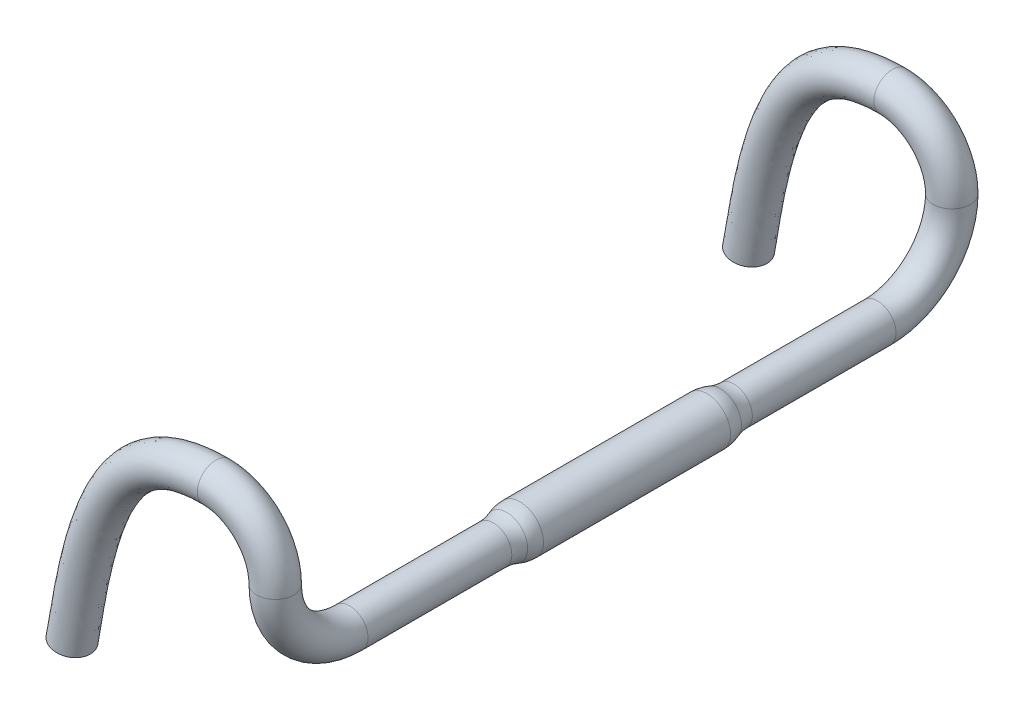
ISO-10303-21;
HEADER;
FILE_DESCRIPTION(('STEP AP214'),'2;1');
FILE_NAME('part.step','',(''),(''),'','','');
FILE_SCHEMA(('AUTOMOTIVE_DESIGN { 1 0 10303 214 1 1 1 1 }'));
ENDSEC;
DATA;
#1=APPLICATION_CONTEXT('core data for automotive mechanical design processes');
#2=APPLICATION_PROTOCOL_DEFINITION('international standard','automotive_design',2000,#1);
#3=PRODUCT_CONTEXT('',#1,'mechanical');
#4=PRODUCT('Part','Part','',(#3));
#5=PRODUCT_RELATED_PRODUCT_CATEGORY('part','',(#4));
#6=PRODUCT_DEFINITION_FORMATION('','',#4);
#7=PRODUCT_DEFINITION_CONTEXT('part definition',#1,'design');
#8=PRODUCT_DEFINITION('design','',#6,#7);
#9=PRODUCT_DEFINITION_SHAPE('','',#8);
#10=(LENGTH_UNIT() NAMED_UNIT(*) SI_UNIT(.MILLI.,.METRE.));
#11=(NAMED_UNIT(*) PLANE_ANGLE_UNIT() SI_UNIT($,.RADIAN.));
#12=(NAMED_UNIT(*) SI_UNIT($,.STERADIAN.) SOLID_ANGLE_UNIT());
#13=UNCERTAINTY_MEASURE_WITH_UNIT(LENGTH_MEASURE(1.E-05),#10,'distance_accuracy_value','');
#14=(GEOMETRIC_REPRESENTATION_CONTEXT(3) GLOBAL_UNCERTAINTY_ASSIGNED_CONTEXT((#13)) GLOBAL_UNIT_ASSIGNED_CONTEXT((#10,
#11,#12)) REPRESENTATION_CONTEXT('',''));
#15=CARTESIAN_POINT('',(0.,0.,0.));
#16=DIRECTION('',(0.,0.,1.));
#17=DIRECTION('',(1.,0.,0.));
#18=AXIS2_PLACEMENT_3D('',#15,#16,#17);
#19=CARTESIAN_POINT('',(0.,0.,81.));
#20=DIRECTION('',(0.,0.,1.));
#21=DIRECTION('',(1.,0.,0.));
#22=AXIS2_PLACEMENT_3D('',#19,#20,#21);
#23=TOROIDAL_SURFACE('',#22,37.8704545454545,25.3704545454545);
#24=CARTESIAN_POINT('',(0.,0.,72.));
#25=DIRECTION('',(0.,0.,1.));
#26=DIRECTION('',(1.,0.,0.));
#27=AXIS2_PLACEMENT_3D('',#24,#25,#26);
#28=CIRCLE('',#27,14.15);
#29=CARTESIAN_POINT('',(14.15,0.,72.));
#30=VERTEX_POINT('',#29);
#31=EDGE_CURVE('E11',#30,#30,#28,.T.);
#32=ORIENTED_EDGE('',*,*,#31,.T.);
#33=EDGE_LOOP('',(#32));
#34=FACE_BOUND('',#33,.T.);
#35=CARTESIAN_POINT('',(0.,0.,81.));
#36=DIRECTION('',(0.,0.,1.));
#37=DIRECTION('',(1.,0.,0.));
#38=AXIS2_PLACEMENT_3D('',#35,#36,#37);
#39=CIRCLE('',#38,12.5);
#40=CARTESIAN_POINT('',(12.5,0.,81.));
#41=VERTEX_POINT('',#40);
#42=EDGE_CURVE('E169',#41,#41,#39,.T.);
#43=ORIENTED_EDGE('',*,*,#42,.F.);
#44=EDGE_LOOP('',(#43));
#45=FACE_BOUND('',#44,.T.);
#46=ADVANCED_FACE('F117',(#34,#45),#23,.F.);
#47=CARTESIAN_POINT('',(0.,0.,63.));
#48=DIRECTION('',(0.,0.,1.));
#49=DIRECTION('',(1.,0.,0.));
#50=AXIS2_PLACEMENT_3D('',#47,#48,#49);
#51=DEGENERATE_TOROIDAL_SURFACE('',#50,9.57045454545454,25.3704545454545,.F.);
#52=CARTESIAN_POINT('',(0.,0.,63.));
#53=DIRECTION('',(0.,0.,1.));
#54=DIRECTION('',(1.,0.,0.));
#55=AXIS2_PLACEMENT_3D('',#52,#53,#54);
#56=CIRCLE('',#55,15.8);
#57=CARTESIAN_POINT('',(15.8,0.,63.));
#58=VERTEX_POINT('',#57);
#59=EDGE_CURVE('E123',#58,#58,#56,.T.);
#60=ORIENTED_EDGE('',*,*,#59,.T.);
#61=EDGE_LOOP('',(#60));
#62=FACE_BOUND('',#61,.T.);
#63=ORIENTED_EDGE('',*,*,#31,.F.);
#64=EDGE_LOOP('',(#63));
#65=FACE_BOUND('',#64,.T.);
#66=ADVANCED_FACE('F238',(#62,#65),#51,.F.);
#67=CARTESIAN_POINT('',(0.,0.,109.303925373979));
#68=DIRECTION('',(0.,0.,1.));
#69=DIRECTION('',(1.,0.,0.));
#70=AXIS2_PLACEMENT_3D('',#67,#68,#69);
#71=CYLINDRICAL_SURFACE('',#70,15.8);
#72=ORIENTED_EDGE('',*,*,#59,.F.);
#73=EDGE_LOOP('',(#72));
#74=FACE_BOUND('',#73,.T.);
#75=CARTESIAN_POINT('',(0.,0.,-63.));
#76=DIRECTION('',(0.,0.,1.));
#77=DIRECTION('',(1.,0.,0.));
#78=AXIS2_PLACEMENT_3D('',#75,#76,#77);
#79=CIRCLE('',#78,15.8);
#80=CARTESIAN_POINT('',(15.8,0.,-63.));
#81=VERTEX_POINT('',#80);
#82=EDGE_CURVE('E127',#81,#81,#79,.T.);
#83=ORIENTED_EDGE('',*,*,#82,.T.);
#84=EDGE_LOOP('',(#83));
#85=FACE_BOUND('',#84,.T.);
#86=ADVANCED_FACE('F242',(#74,#85),#71,.T.);
#87=CARTESIAN_POINT('',(0.,0.,-63.));
#88=DIRECTION('',(0.,0.,1.));
#89=DIRECTION('',(1.,0.,0.));
#90=AXIS2_PLACEMENT_3D('',#87,#88,#89);
#91=DEGENERATE_TOROIDAL_SURFACE('',#90,9.57045454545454,25.3704545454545,.F.);
#92=ORIENTED_EDGE('',*,*,#82,.F.);
#93=EDGE_LOOP('',(#92));
#94=FACE_BOUND('',#93,.T.);
#95=CARTESIAN_POINT('',(0.,0.,-72.));
#96=DIRECTION('',(0.,0.,1.));
#97=DIRECTION('',(1.,0.,0.));
#98=AXIS2_PLACEMENT_3D('',#95,#96,#97);
#99=CIRCLE('',#98,14.15);
#100=CARTESIAN_POINT('',(14.15,0.,-72.));
#101=VERTEX_POINT('',#100);
#102=EDGE_CURVE('E131',#101,#101,#99,.T.);
#103=ORIENTED_EDGE('',*,*,#102,.T.);
#104=EDGE_LOOP('',(#103));
#105=FACE_BOUND('',#104,.T.);
#106=ADVANCED_FACE('F303',(#94,#105),#91,.F.);
#107=CARTESIAN_POINT('',(0.,0.,-81.));
#108=DIRECTION('',(0.,0.,1.));
#109=DIRECTION('',(1.,0.,0.));
#110=AXIS2_PLACEMENT_3D('',#107,#108,#109);
#111=TOROIDAL_SURFACE('',#110,37.8704545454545,25.3704545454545);
#112=ORIENTED_EDGE('',*,*,#102,.F.);
#113=EDGE_LOOP('',(#112));
#114=FACE_BOUND('',#113,.T.);
#115=CARTESIAN_POINT('',(0.,0.,-81.));
#116=DIRECTION('',(0.,0.,1.));
#117=DIRECTION('',(1.,0.,0.));
#118=AXIS2_PLACEMENT_3D('',#115,#116,#117);
#119=CIRCLE('',#118,12.5);
#120=CARTESIAN_POINT('',(12.5,0.,-81.));
#121=VERTEX_POINT('',#120);
#122=EDGE_CURVE('E136',#121,#121,#119,.T.);
#123=ORIENTED_EDGE('',*,*,#122,.T.);
#124=EDGE_LOOP('',(#123));
#125=FACE_BOUND('',#124,.T.);
#126=ADVANCED_FACE('F299',(#114,#125),#111,.F.);
#127=CARTESIAN_POINT('',(0.,0.,109.303925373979));
#128=DIRECTION('',(0.,0.,1.));
#129=DIRECTION('',(1.,0.,0.));
#130=AXIS2_PLACEMENT_3D('',#127,#128,#129);
#131=CYLINDRICAL_SURFACE('',#130,12.5);
#132=CARTESIAN_POINT('',(0.,0.,-177.8));
#133=DIRECTION('',(0.,0.,1.));
#134=DIRECTION('',(1.,0.,0.));
#135=AXIS2_PLACEMENT_3D('',#132,#133,#134);
#136=CIRCLE('',#135,12.5);
#137=CARTESIAN_POINT('',(12.5,0.,-177.8));
#138=VERTEX_POINT('',#137);
#139=EDGE_CURVE('E202',#138,#138,#136,.T.);
#140=ORIENTED_EDGE('',*,*,#139,.T.);
#141=EDGE_LOOP('',(#140));
#142=FACE_BOUND('',#141,.T.);
#143=ORIENTED_EDGE('',*,*,#122,.F.);
#144=EDGE_LOOP('',(#143));
#145=FACE_BOUND('',#144,.T.);
#146=ADVANCED_FACE('F295',(#142,#145),#131,.T.);
#147=CARTESIAN_POINT('',(0.,0.,109.303925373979));
#148=DIRECTION('',(0.,0.,1.));
#149=DIRECTION('',(1.,0.,0.));
#150=AXIS2_PLACEMENT_3D('',#147,#148,#149);
#151=CYLINDRICAL_SURFACE('',#150,10.5);
#152=CARTESIAN_POINT('',(0.,0.,-177.8));
#153=DIRECTION('',(0.,0.,1.));
#154=DIRECTION('',(1.,0.,0.));
#155=AXIS2_PLACEMENT_3D('',#152,#153,#154);
#156=CIRCLE('',#155,10.5);
#157=CARTESIAN_POINT('',(10.5,0.,-177.8));
#158=VERTEX_POINT('',#157);
#159=EDGE_CURVE('E139',#158,#158,#156,.T.);
#160=ORIENTED_EDGE('',*,*,#159,.F.);
#161=EDGE_LOOP('',(#160));
#162=FACE_BOUND('',#161,.T.);
#163=CARTESIAN_POINT('',(0.,0.,-81.));
#164=DIRECTION('',(0.,0.,1.));
#165=DIRECTION('',(1.,0.,0.));
#166=AXIS2_PLACEMENT_3D('',#163,#164,#165);
#167=CIRCLE('',#166,10.5);
#168=CARTESIAN_POINT('',(10.5,0.,-81.));
#169=VERTEX_POINT('',#168);
#170=EDGE_CURVE('E142',#169,#169,#167,.T.);
#171=ORIENTED_EDGE('',*,*,#170,.T.);
#172=EDGE_LOOP('',(#171));
#173=FACE_BOUND('',#172,.T.);
#174=ADVANCED_FACE('F291',(#162,#173),#151,.F.);
#175=CARTESIAN_POINT('',(0.,0.,-81.));
#176=DIRECTION('',(0.,0.,1.));
#177=DIRECTION('',(1.,0.,0.));
#178=AXIS2_PLACEMENT_3D('',#175,#176,#177);
#179=CONICAL_SURFACE('',#178,10.5,0.0365438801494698);
#180=CARTESIAN_POINT('',(0.,0.,-79.001335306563));
#181=DIRECTION('',(0.,0.,1.));
#182=DIRECTION('',(1.,0.,0.));
#183=AXIS2_PLACEMENT_3D('',#180,#181,#182);
#184=CIRCLE('',#183,10.5730714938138);
#185=CARTESIAN_POINT('',(10.5730714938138,0.,-79.001335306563));
#186=VERTEX_POINT('',#185);
#187=EDGE_CURVE('E145',#186,#186,#184,.T.);
#188=ORIENTED_EDGE('',*,*,#187,.T.);
#189=EDGE_LOOP('',(#188));
#190=FACE_BOUND('',#189,.T.);
#191=ORIENTED_EDGE('',*,*,#170,.F.);
#192=EDGE_LOOP('',(#191));
#193=FACE_BOUND('',#192,.T.);
#194=ADVANCED_FACE('F287',(#190,#193),#179,.F.);
#195=CARTESIAN_POINT('',(0.,0.,-81.));
#196=DIRECTION('',(0.,0.,1.));
#197=DIRECTION('',(1.,0.,0.));
#198=AXIS2_PLACEMENT_3D('',#195,#196,#197);
#199=TOROIDAL_SURFACE('',#198,37.8704545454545,27.3704545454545);
#200=CARTESIAN_POINT('',(0.,0.,-71.2905133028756));
#201=DIRECTION('',(0.,0.,1.));
#202=DIRECTION('',(1.,0.,0.));
#203=AXIS2_PLACEMENT_3D('',#200,#201,#202);
#204=CIRCLE('',#203,12.2800725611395);
#205=CARTESIAN_POINT('',(12.2800725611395,0.,-71.2905133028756));
#206=VERTEX_POINT('',#205);
#207=EDGE_CURVE('E148',#206,#206,#204,.T.);
#208=ORIENTED_EDGE('',*,*,#207,.T.);
#209=EDGE_LOOP('',(#208));
#210=FACE_BOUND('',#209,.T.);
#211=ORIENTED_EDGE('',*,*,#187,.F.);
#212=EDGE_LOOP('',(#211));
#213=FACE_BOUND('',#212,.T.);
#214=ADVANCED_FACE('F283',(#210,#213),#199,.T.);
#215=CARTESIAN_POINT('',(0.,0.,-63.));
#216=DIRECTION('',(0.,0.,1.));
#217=DIRECTION('',(1.,0.,0.));
#218=AXIS2_PLACEMENT_3D('',#215,#216,#217);
#219=DEGENERATE_TOROIDAL_SURFACE('',#218,9.57045454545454,23.3704545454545,.F.);
#220=CARTESIAN_POINT('',(0.,0.,-63.));
#221=DIRECTION('',(0.,0.,1.));
#222=DIRECTION('',(1.,0.,0.));
#223=AXIS2_PLACEMENT_3D('',#220,#221,#222);
#224=CIRCLE('',#223,13.8);
#225=CARTESIAN_POINT('',(13.8,0.,-63.));
#226=VERTEX_POINT('',#225);
#227=EDGE_CURVE('E151',#226,#226,#224,.T.);
#228=ORIENTED_EDGE('',*,*,#227,.T.);
#229=EDGE_LOOP('',(#228));
#230=FACE_BOUND('',#229,.T.);
#231=ORIENTED_EDGE('',*,*,#207,.F.);
#232=EDGE_LOOP('',(#231));
#233=FACE_BOUND('',#232,.T.);
#234=ADVANCED_FACE('F279',(#230,#233),#219,.T.);
#235=CARTESIAN_POINT('',(0.,0.,109.303925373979));
#236=DIRECTION('',(0.,0.,1.));
#237=DIRECTION('',(1.,0.,0.));
#238=AXIS2_PLACEMENT_3D('',#235,#236,#237);
#239=CYLINDRICAL_SURFACE('',#238,13.8);
#240=ORIENTED_EDGE('',*,*,#227,.F.);
#241=EDGE_LOOP('',(#240));
#242=FACE_BOUND('',#241,.T.);
#243=CARTESIAN_POINT('',(0.,0.,63.));
#244=DIRECTION('',(0.,0.,1.));
#245=DIRECTION('',(1.,0.,0.));
#246=AXIS2_PLACEMENT_3D('',#243,#244,#245);
#247=CIRCLE('',#246,13.8);
#248=CARTESIAN_POINT('',(13.8,0.,63.));
#249=VERTEX_POINT('',#248);
#250=EDGE_CURVE('E154',#249,#249,#247,.T.);
#251=ORIENTED_EDGE('',*,*,#250,.T.);
#252=EDGE_LOOP('',(#251));
#253=FACE_BOUND('',#252,.T.);
#254=ADVANCED_FACE('F275',(#242,#253),#239,.F.);
#255=CARTESIAN_POINT('',(0.,0.,63.));
#256=DIRECTION('',(0.,0.,1.));
#257=DIRECTION('',(1.,0.,0.));
#258=AXIS2_PLACEMENT_3D('',#255,#256,#257);
#259=DEGENERATE_TOROIDAL_SURFACE('',#258,9.57045454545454,23.3704545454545,.F.);
#260=ORIENTED_EDGE('',*,*,#250,.F.);
#261=EDGE_LOOP('',(#260));
#262=FACE_BOUND('',#261,.T.);
#263=CARTESIAN_POINT('',(0.,0.,71.2905133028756));
#264=DIRECTION('',(0.,0.,1.));
#265=DIRECTION('',(1.,0.,0.));
#266=AXIS2_PLACEMENT_3D('',#263,#264,#265);
#267=CIRCLE('',#266,12.2800725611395);
#268=CARTESIAN_POINT('',(12.2800725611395,0.,71.2905133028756));
#269=VERTEX_POINT('',#268);
#270=EDGE_CURVE('E157',#269,#269,#267,.T.);
#271=ORIENTED_EDGE('',*,*,#270,.T.);
#272=EDGE_LOOP('',(#271));
#273=FACE_BOUND('',#272,.T.);
#274=ADVANCED_FACE('F271',(#262,#273),#259,.T.);
#275=CARTESIAN_POINT('',(0.,0.,81.));
#276=DIRECTION('',(0.,0.,1.));
#277=DIRECTION('',(1.,0.,0.));
#278=AXIS2_PLACEMENT_3D('',#275,#276,#277);
#279=TOROIDAL_SURFACE('',#278,37.8704545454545,27.3704545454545);
#280=ORIENTED_EDGE('',*,*,#270,.F.);
#281=EDGE_LOOP('',(#280));
#282=FACE_BOUND('',#281,.T.);
#283=CARTESIAN_POINT('',(0.,0.,79.0013353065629));
#284=DIRECTION('',(0.,0.,1.));
#285=DIRECTION('',(1.,0.,0.));
#286=AXIS2_PLACEMENT_3D('',#283,#284,#285);
#287=CIRCLE('',#286,10.5730714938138);
#288=CARTESIAN_POINT('',(10.5730714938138,0.,79.0013353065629));
#289=VERTEX_POINT('',#288);
#290=EDGE_CURVE('E160',#289,#289,#287,.T.);
#291=ORIENTED_EDGE('',*,*,#290,.T.);
#292=EDGE_LOOP('',(#291));
#293=FACE_BOUND('',#292,.T.);
#294=ADVANCED_FACE('F267',(#282,#293),#279,.T.);
#295=CARTESIAN_POINT('',(0.,0.,81.));
#296=DIRECTION('',(0.,0.,-1.));
#297=DIRECTION('',(-1.,0.,0.));
#298=AXIS2_PLACEMENT_3D('',#295,#296,#297);
#299=CONICAL_SURFACE('',#298,10.5,0.0365438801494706);
#300=ORIENTED_EDGE('',*,*,#290,.F.);
#301=EDGE_LOOP('',(#300));
#302=FACE_BOUND('',#301,.T.);
#303=CARTESIAN_POINT('',(0.,0.,81.));
#304=DIRECTION('',(0.,0.,1.));
#305=DIRECTION('',(1.,0.,0.));
#306=AXIS2_PLACEMENT_3D('',#303,#304,#305);
#307=CIRCLE('',#306,10.5);
#308=CARTESIAN_POINT('',(10.5,0.,81.));
#309=VERTEX_POINT('',#308);
#310=EDGE_CURVE('E163',#309,#309,#307,.T.);
#311=ORIENTED_EDGE('',*,*,#310,.T.);
#312=EDGE_LOOP('',(#311));
#313=FACE_BOUND('',#312,.T.);
#314=ADVANCED_FACE('F259',(#302,#313),#299,.F.);
#315=CARTESIAN_POINT('',(0.,0.,109.303925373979));
#316=DIRECTION('',(0.,0.,1.));
#317=DIRECTION('',(1.,0.,0.));
#318=AXIS2_PLACEMENT_3D('',#315,#316,#317);
#319=CYLINDRICAL_SURFACE('',#318,10.5);
#320=CARTESIAN_POINT('',(0.,0.,177.8));
#321=DIRECTION('',(0.,0.,1.));
#322=DIRECTION('',(1.,0.,0.));
#323=AXIS2_PLACEMENT_3D('',#320,#321,#322);
#324=CIRCLE('',#323,10.5);
#325=CARTESIAN_POINT('',(10.5,0.,177.8));
#326=VERTEX_POINT('',#325);
#327=EDGE_CURVE('E181',#326,#326,#324,.T.);
#328=ORIENTED_EDGE('',*,*,#327,.T.);
#329=EDGE_LOOP('',(#328));
#330=FACE_BOUND('',#329,.T.);
#331=ORIENTED_EDGE('',*,*,#310,.F.);
#332=EDGE_LOOP('',(#331));
#333=FACE_BOUND('',#332,.T.);
#334=ADVANCED_FACE('F249',(#330,#333),#319,.F.);
#335=CARTESIAN_POINT('',(0.,0.,109.303925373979));
#336=DIRECTION('',(0.,0.,1.));
#337=DIRECTION('',(1.,0.,0.));
#338=AXIS2_PLACEMENT_3D('',#335,#336,#337);
#339=CYLINDRICAL_SURFACE('',#338,12.5);
#340=CARTESIAN_POINT('',(0.,0.,177.8));
#341=DIRECTION('',(0.,0.,1.));
#342=DIRECTION('',(1.,0.,0.));
#343=AXIS2_PLACEMENT_3D('',#340,#341,#342);
#344=CIRCLE('',#343,12.5);
#345=CARTESIAN_POINT('',(12.5,0.,177.8));
#346=VERTEX_POINT('',#345);
#347=EDGE_CURVE('E166',#346,#346,#344,.T.);
#348=ORIENTED_EDGE('',*,*,#347,.F.);
#349=EDGE_LOOP('',(#348));
#350=FACE_BOUND('',#349,.T.);
#351=ORIENTED_EDGE('',*,*,#42,.T.);
#352=EDGE_LOOP('',(#351));
#353=FACE_BOUND('',#352,.T.);
#354=ADVANCED_FACE('F246',(#350,#353),#339,.T.);
#355=CARTESIAN_POINT('',(-40.,50.,227.8));
#356=DIRECTION('',(0.,0.,1.));
#357=DIRECTION('',(1.,0.,0.));
#358=AXIS2_PLACEMENT_3D('',#355,#356,#357);
#359=TOROIDAL_SURFACE('',#358,40.,12.5);
#360=CARTESIAN_POINT('',(0.,50.,227.8));
#361=DIRECTION('',(0.,1.,0.));
#362=DIRECTION('',(1.,0.,0.));
#363=AXIS2_PLACEMENT_3D('',#360,#361,#362);
#364=CIRCLE('',#363,12.5);
#365=CARTESIAN_POINT('',(12.5,50.,227.8));
#366=VERTEX_POINT('',#365);
#367=EDGE_CURVE('E175',#366,#366,#364,.T.);
#368=CARTESIAN_POINT('',(-40.,90.,227.8));
#369=DIRECTION('',(-1.,0.,0.));
#370=DIRECTION('',(0.,1.,0.));
#371=AXIS2_PLACEMENT_3D('',#368,#369,#370);
#372=CIRCLE('',#371,12.5);
#373=CARTESIAN_POINT('',(-40.,102.5,227.8));
#374=VERTEX_POINT('',#373);
#375=EDGE_CURVE('E172',#374,#374,#372,.T.);
#376=CARTESIAN_POINT('',(-40.,50.,227.8));
#377=DIRECTION('',(0.,0.,1.));
#378=DIRECTION('',(1.,0.,0.));
#379=AXIS2_PLACEMENT_3D('',#376,#377,#378);
#380=CIRCLE('',#379,52.5);
#381=EDGE_CURVE('',#366,#374,#380,.T.);
#382=ORIENTED_EDGE('',*,*,#367,.T.);
#383=ORIENTED_EDGE('',*,*,#375,.F.);
#384=ORIENTED_EDGE('',*,*,#381,.T.);
#385=ORIENTED_EDGE('',*,*,#381,.F.);
#386=EDGE_LOOP('',(#382,#384,#383,#385));
#387=FACE_BOUND('',#386,.T.);
#388=ADVANCED_FACE('F248',(#387),#359,.T.);
#389=CARTESIAN_POINT('',(-40.,50.,227.8));
#390=DIRECTION('',(0.,0.,1.));
#391=DIRECTION('',(1.,0.,0.));
#392=AXIS2_PLACEMENT_3D('',#389,#390,#391);
#393=TOROIDAL_SURFACE('',#392,40.,10.5);
#394=CARTESIAN_POINT('',(0.,50.,227.8));
#395=DIRECTION('',(0.,1.,0.));
#396=DIRECTION('',(1.,0.,0.));
#397=AXIS2_PLACEMENT_3D('',#394,#395,#396);
#398=CIRCLE('',#397,10.5);
#399=CARTESIAN_POINT('',(10.5,50.,227.8));
#400=VERTEX_POINT('',#399);
#401=EDGE_CURVE('E178',#400,#400,#398,.T.);
#402=CARTESIAN_POINT('',(-40.,90.,227.8));
#403=DIRECTION('',(-1.,0.,0.));
#404=DIRECTION('',(0.,-1.,0.));
#405=AXIS2_PLACEMENT_3D('',#402,#403,#404);
#406=CIRCLE('',#405,10.5);
#407=CARTESIAN_POINT('',(-40.,100.5,227.8));
#408=VERTEX_POINT('',#407);
#409=EDGE_CURVE('E184',#408,#408,#406,.T.);
#410=CARTESIAN_POINT('',(-40.,50.,227.8));
#411=DIRECTION('',(0.,0.,1.));
#412=DIRECTION('',(1.,0.,0.));
#413=AXIS2_PLACEMENT_3D('',#410,#411,#412);
#414=CIRCLE('',#413,50.5);
#415=EDGE_CURVE('',#400,#408,#414,.T.);
#416=ORIENTED_EDGE('',*,*,#401,.F.);
#417=ORIENTED_EDGE('',*,*,#409,.T.);
#418=ORIENTED_EDGE('',*,*,#415,.T.);
#419=ORIENTED_EDGE('',*,*,#415,.F.);
#420=EDGE_LOOP('',(#416,#418,#417,#419));
#421=FACE_BOUND('',#420,.T.);
#422=ADVANCED_FACE('F256',(#421),#393,.F.);
#423=CARTESIAN_POINT('',(0.,50.,177.8));
#424=DIRECTION('',(1.,0.,0.));
#425=DIRECTION('',(0.,1.,0.));
#426=AXIS2_PLACEMENT_3D('',#423,#424,#425);
#427=TOROIDAL_SURFACE('',#426,50.,10.5);
#428=ORIENTED_EDGE('',*,*,#401,.T.);
#429=EDGE_LOOP('',(#428));
#430=FACE_BOUND('',#429,.T.);
#431=ORIENTED_EDGE('',*,*,#327,.F.);
#432=EDGE_LOOP('',(#431));
#433=FACE_BOUND('',#432,.T.);
#434=ADVANCED_FACE('F388',(#430,#433),#427,.F.);
#435=CARTESIAN_POINT('',(0.,50.,177.8));
#436=DIRECTION('',(1.,0.,0.));
#437=DIRECTION('',(0.,1.,0.));
#438=AXIS2_PLACEMENT_3D('',#435,#436,#437);
#439=TOROIDAL_SURFACE('',#438,50.,12.5);
#440=ORIENTED_EDGE('',*,*,#367,.F.);
#441=EDGE_LOOP('',(#440));
#442=FACE_BOUND('',#441,.T.);
#443=ORIENTED_EDGE('',*,*,#347,.T.);
#444=EDGE_LOOP('',(#443));
#445=FACE_BOUND('',#444,.T.);
#446=ADVANCED_FACE('F397',(#442,#445),#439,.T.);
#447=CARTESIAN_POINT('',(-136.851752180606,-50.8,227.8));
#448=DIRECTION('',(-0.175546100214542,-0.984471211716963,0.));
#449=DIRECTION('',(0.984471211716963,-0.175546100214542,0.));
#450=AXIS2_PLACEMENT_3D('',#447,#448,#449);
#451=PLANE('',#450);
#452=CARTESIAN_POINT('',(-136.851752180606,-50.8,227.8));
#453=DIRECTION('',(-0.175546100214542,-0.984471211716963,0.));
#454=DIRECTION('',(0.984471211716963,-0.175546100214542,0.));
#455=AXIS2_PLACEMENT_3D('',#452,#453,#454);
#456=CIRCLE('',#455,10.5);
#457=CARTESIAN_POINT('',(-126.514804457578,-52.6432340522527,227.8));
#458=VERTEX_POINT('',#457);
#459=EDGE_CURVE('E188',#458,#458,#456,.T.);
#460=ORIENTED_EDGE('',*,*,#459,.F.);
#461=EDGE_LOOP('',(#460));
#462=FACE_BOUND('',#461,.T.);
#463=CARTESIAN_POINT('',(-136.851752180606,-50.8,227.8));
#464=DIRECTION('',(-0.175546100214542,-0.984471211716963,0.));
#465=DIRECTION('',(0.984471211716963,-0.175546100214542,0.));
#466=AXIS2_PLACEMENT_3D('',#463,#464,#465);
#467=CIRCLE('',#466,12.5);
#468=CARTESIAN_POINT('',(-124.545862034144,-52.9943262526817,227.8));
#469=VERTEX_POINT('',#468);
#470=EDGE_CURVE('E185',#469,#469,#467,.T.);
#471=ORIENTED_EDGE('',*,*,#470,.T.);
#472=EDGE_LOOP('',(#471));
#473=FACE_BOUND('',#472,.T.);
#474=ADVANCED_FACE('F407',(#462,#473),#451,.T.);
#475=CARTESIAN_POINT('',(-40.,77.5,227.8));
#476=CARTESIAN_POINT('',(-44.5161005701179,77.5192481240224,227.8));
#477=CARTESIAN_POINT('',(-52.8849439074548,76.913175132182,227.8));
#478=CARTESIAN_POINT('',(-63.3005714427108,74.5829617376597,227.8));
#479=CARTESIAN_POINT('',(-72.0528187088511,70.9827048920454,227.8));
#480=CARTESIAN_POINT('',(-80.3897052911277,65.6878802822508,227.8));
#481=CARTESIAN_POINT('',(-85.8345699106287,60.5046279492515,227.8));
#482=CARTESIAN_POINT('',(-91.2375301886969,54.1047218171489,227.8));
#483=CARTESIAN_POINT('',(-96.3050171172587,46.92915013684,227.8));
#484=CARTESIAN_POINT('',(-104.822446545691,30.6572216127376,227.8));
#485=CARTESIAN_POINT('',(-113.195122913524,5.90104740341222,227.8));
#486=CARTESIAN_POINT('',(-119.86792866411,-25.2954054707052,227.8));
#487=CARTESIAN_POINT('',(-123.043822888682,-44.5768008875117,227.8));
#488=CARTESIAN_POINT('',(-124.545862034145,-52.9943262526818,227.8));
#489=CARTESIAN_POINT('',(-40.,77.5,202.8));
#490=CARTESIAN_POINT('',(-44.5161005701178,77.5192481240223,202.8));
#491=CARTESIAN_POINT('',(-52.8849439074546,76.9131751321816,202.8));
#492=CARTESIAN_POINT('',(-63.3005714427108,74.5829617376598,202.8));
#493=CARTESIAN_POINT('',(-72.052818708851,70.9827048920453,202.8));
#494=CARTESIAN_POINT('',(-80.3897052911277,65.6878802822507,202.8));
#495=CARTESIAN_POINT('',(-85.8345699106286,60.5046279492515,202.8));
#496=CARTESIAN_POINT('',(-91.2375301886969,54.1047218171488,202.8));
#497=CARTESIAN_POINT('',(-96.3050171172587,46.92915013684,202.8));
#498=CARTESIAN_POINT('',(-104.822446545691,30.6572216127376,202.8));
#499=CARTESIAN_POINT('',(-113.195122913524,5.90104740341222,202.8));
#500=CARTESIAN_POINT('',(-119.86792866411,-25.2954054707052,202.8));
#501=CARTESIAN_POINT('',(-123.043822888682,-44.5768008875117,202.8));
#502=CARTESIAN_POINT('',(-124.545862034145,-52.9943262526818,202.8));
#503=CARTESIAN_POINT('',(-40.,102.5,202.8));
#504=CARTESIAN_POINT('',(-45.6345520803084,102.480751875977,202.8));
#505=CARTESIAN_POINT('',(-56.2402984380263,101.797686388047,202.8));
#506=CARTESIAN_POINT('',(-70.6805183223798,98.595592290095,202.8));
#507=CARTESIAN_POINT('',(-83.552191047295,93.3337575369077,202.8));
#508=CARTESIAN_POINT('',(-96.0665291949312,85.3807376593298,202.8));
#509=CARTESIAN_POINT('',(-103.884468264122,77.8761073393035,202.8));
#510=CARTESIAN_POINT('',(-111.257005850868,69.1516882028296,202.8));
#511=CARTESIAN_POINT('',(-117.827370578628,59.7884503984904,202.8));
#512=CARTESIAN_POINT('',(-128.131564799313,40.0002891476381,202.8));
#513=CARTESIAN_POINT('',(-137.421174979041,12.2514983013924,202.8));
#514=CARTESIAN_POINT('',(-144.497106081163,-20.9684102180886,202.8));
#515=CARTESIAN_POINT('',(-147.661402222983,-40.2087007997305,202.8));
#516=CARTESIAN_POINT('',(-149.157642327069,-48.6056737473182,202.8));
#517=CARTESIAN_POINT('',(-40.,102.5,227.8));
#518=CARTESIAN_POINT('',(-45.6345520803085,102.480751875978,227.8));
#519=CARTESIAN_POINT('',(-56.2402984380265,101.797686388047,227.8));
#520=CARTESIAN_POINT('',(-70.6805183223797,98.5955922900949,227.8));
#521=CARTESIAN_POINT('',(-83.552191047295,93.3337575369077,227.8));
#522=CARTESIAN_POINT('',(-96.0665291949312,85.3807376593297,227.8));
#523=CARTESIAN_POINT('',(-103.884468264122,77.8761073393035,227.8));
#524=CARTESIAN_POINT('',(-111.257005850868,69.1516882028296,227.8));
#525=CARTESIAN_POINT('',(-117.827370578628,59.7884503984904,227.8));
#526=CARTESIAN_POINT('',(-128.131564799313,40.000289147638,227.8));
#527=CARTESIAN_POINT('',(-137.421174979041,12.2514983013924,227.8));
#528=CARTESIAN_POINT('',(-144.497106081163,-20.9684102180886,227.8));
#529=CARTESIAN_POINT('',(-147.661402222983,-40.2087007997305,227.8));
#530=CARTESIAN_POINT('',(-149.157642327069,-48.6056737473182,227.8));
#531=CARTESIAN_POINT('',(-40.,102.5,252.8));
#532=CARTESIAN_POINT('',(-45.6345520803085,102.480751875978,252.8));
#533=CARTESIAN_POINT('',(-56.2402984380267,101.797686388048,252.8));
#534=CARTESIAN_POINT('',(-70.6805183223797,98.5955922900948,252.8));
#535=CARTESIAN_POINT('',(-83.552191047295,93.3337575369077,252.8));
#536=CARTESIAN_POINT('',(-96.0665291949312,85.3807376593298,252.8));
#537=CARTESIAN_POINT('',(-103.884468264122,77.8761073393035,252.8));
#538=CARTESIAN_POINT('',(-111.257005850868,69.1516882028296,252.8));
#539=CARTESIAN_POINT('',(-117.827370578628,59.7884503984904,252.8));
#540=CARTESIAN_POINT('',(-128.131564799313,40.0002891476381,252.8));
#541=CARTESIAN_POINT('',(-137.421174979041,12.2514983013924,252.8));
#542=CARTESIAN_POINT('',(-144.497106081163,-20.9684102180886,252.8));
#543=CARTESIAN_POINT('',(-147.661402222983,-40.2087007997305,252.8));
#544=CARTESIAN_POINT('',(-149.157642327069,-48.6056737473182,252.8));
#545=CARTESIAN_POINT('',(-40.,77.5,252.8));
#546=CARTESIAN_POINT('',(-44.516100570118,77.5192481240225,252.8));
#547=CARTESIAN_POINT('',(-52.8849439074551,76.9131751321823,252.8));
#548=CARTESIAN_POINT('',(-63.3005714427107,74.5829617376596,252.8));
#549=CARTESIAN_POINT('',(-72.0528187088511,70.9827048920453,252.8));
#550=CARTESIAN_POINT('',(-80.3897052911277,65.6878802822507,252.8));
#551=CARTESIAN_POINT('',(-85.8345699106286,60.5046279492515,252.8));
#552=CARTESIAN_POINT('',(-91.2375301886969,54.1047218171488,252.8));
#553=CARTESIAN_POINT('',(-96.3050171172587,46.92915013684,252.8));
#554=CARTESIAN_POINT('',(-104.822446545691,30.6572216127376,252.8));
#555=CARTESIAN_POINT('',(-113.195122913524,5.90104740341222,252.8));
#556=CARTESIAN_POINT('',(-119.86792866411,-25.2954054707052,252.8));
#557=CARTESIAN_POINT('',(-123.043822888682,-44.5768008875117,252.8));
#558=CARTESIAN_POINT('',(-124.545862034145,-52.9943262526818,252.8));
#559=CARTESIAN_POINT('',(-40.,77.5,227.8));
#560=CARTESIAN_POINT('',(-44.5161005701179,77.5192481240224,227.8));
#561=CARTESIAN_POINT('',(-52.8849439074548,76.913175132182,227.8));
#562=CARTESIAN_POINT('',(-63.3005714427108,74.5829617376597,227.8));
#563=CARTESIAN_POINT('',(-72.0528187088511,70.9827048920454,227.8));
#564=CARTESIAN_POINT('',(-80.3897052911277,65.6878802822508,227.8));
#565=CARTESIAN_POINT('',(-85.8345699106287,60.5046279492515,227.8));
#566=CARTESIAN_POINT('',(-91.2375301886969,54.1047218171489,227.8));
#567=CARTESIAN_POINT('',(-96.3050171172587,46.92915013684,227.8));
#568=CARTESIAN_POINT('',(-104.822446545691,30.6572216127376,227.8));
#569=CARTESIAN_POINT('',(-113.195122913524,5.90104740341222,227.8));
#570=CARTESIAN_POINT('',(-119.86792866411,-25.2954054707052,227.8));
#571=CARTESIAN_POINT('',(-123.043822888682,-44.5768008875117,227.8));
#572=CARTESIAN_POINT('',(-124.545862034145,-52.9943262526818,227.8));
#573=(BOUNDED_SURFACE() B_SPLINE_SURFACE(3,3,((#475,#476,#477,#478,#479,#480,#481,#482,#483,
#484,#485,#486,#487,#488),(#489,#490,#491,#492,#493,#494,#495,#496,#497,#498,#499,#500,#501,
#502),(#503,#504,#505,#506,#507,#508,#509,#510,#511,#512,#513,#514,#515,#516),(#517,#518,#519,
#520,#521,#522,#523,#524,#525,#526,#527,#528,#529,#530),(#531,#532,#533,#534,#535,#536,#537,
#538,#539,#540,#541,#542,#543,#544),(#545,#546,#547,#548,#549,#550,#551,#552,#553,#554,#555,
#556,#557,#558),(#559,#560,#561,#562,#563,#564,#565,#566,#567,#568,#569,#570,#571,#572)),
.UNSPECIFIED.,.T.,.F.,.F.) B_SPLINE_SURFACE_WITH_KNOTS((4,3,4),(4,1,1,1,1,1,1,1,1,1,1,4),(0.,
0.5,1.),(0.,0.0625,0.125,0.1875,0.25,0.333333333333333,0.34421201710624,0.416666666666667,0.5,
0.666666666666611,0.833333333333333,1.),
.UNSPECIFIED.) GEOMETRIC_REPRESENTATION_ITEM() RATIONAL_B_SPLINE_SURFACE(((1.,1.,1.,1.,1.,1.,1.,
1.,1.,1.,1.,1.,1.,1.),(0.333333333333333,0.333333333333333,0.333333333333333,0.333333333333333,
0.333333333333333,0.333333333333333,0.333333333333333,0.333333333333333,0.333333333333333,
0.333333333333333,0.333333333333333,0.333333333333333,0.333333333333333,0.333333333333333),
(0.333333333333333,0.333333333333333,0.333333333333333,0.333333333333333,0.333333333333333,
0.333333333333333,0.333333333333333,0.333333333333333,0.333333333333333,0.333333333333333,
0.333333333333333,0.333333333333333,0.333333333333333,0.333333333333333),(1.,1.,1.,1.,1.,1.,1.,
1.,1.,1.,1.,1.,1.,1.),(0.333333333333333,0.333333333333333,0.333333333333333,0.333333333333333,
0.333333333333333,0.333333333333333,0.333333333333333,0.333333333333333,0.333333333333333,
0.333333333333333,0.333333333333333,0.333333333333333,0.333333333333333,0.333333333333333),
(0.333333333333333,0.333333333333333,0.333333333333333,0.333333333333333,0.333333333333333,
0.333333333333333,0.333333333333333,0.333333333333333,0.333333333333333,0.333333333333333,
0.333333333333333,0.333333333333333,0.333333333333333,0.333333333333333),(1.,1.,1.,1.,1.,1.,1.,
1.,1.,1.,1.,1.,1.,1.))) REPRESENTATION_ITEM('') SURFACE());
#574=ORIENTED_EDGE('',*,*,#375,.T.);
#575=EDGE_LOOP('',(#574));
#576=FACE_BOUND('',#575,.T.);
#577=ORIENTED_EDGE('',*,*,#470,.F.);
#578=EDGE_LOOP('',(#577));
#579=FACE_BOUND('',#578,.T.);
#580=ADVANCED_FACE('F417',(#576,#579),#573,.F.);
#581=CARTESIAN_POINT('',(-40.,79.5,227.8));
#582=CARTESIAN_POINT('',(-44.6055766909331,79.5161684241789,227.8));
#583=CARTESIAN_POINT('',(-53.1533722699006,78.9039360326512,227.8));
#584=CARTESIAN_POINT('',(-63.8909671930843,76.5039721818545,227.8));
#585=CARTESIAN_POINT('',(-72.9727684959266,72.7707891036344,227.8));
#586=CARTESIAN_POINT('',(-81.643851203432,67.2633088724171,227.8));
#587=CARTESIAN_POINT('',(-87.2785617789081,61.8943463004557,227.8));
#588=CARTESIAN_POINT('',(-92.8390882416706,55.3084791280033,227.8));
#589=CARTESIAN_POINT('',(-98.0268053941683,47.957894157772,227.8));
#590=CARTESIAN_POINT('',(-106.68717600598,31.4046670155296,227.8));
#591=CARTESIAN_POINT('',(-115.133207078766,6.40908347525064,227.8));
#592=CARTESIAN_POINT('',(-121.838262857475,-24.9492458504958,227.8));
#593=CARTESIAN_POINT('',(-125.013229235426,-44.2273528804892,227.8));
#594=CARTESIAN_POINT('',(-126.514804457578,-52.6432340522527,227.8));
#595=CARTESIAN_POINT('',(-40.,79.5,206.8));
#596=CARTESIAN_POINT('',(-44.6055766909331,79.5161684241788,206.8));
#597=CARTESIAN_POINT('',(-53.1533722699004,78.903936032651,206.8));
#598=CARTESIAN_POINT('',(-63.8909671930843,76.5039721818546,206.8));
#599=CARTESIAN_POINT('',(-72.9727684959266,72.7707891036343,206.8));
#600=CARTESIAN_POINT('',(-81.643851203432,67.2633088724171,206.8));
#601=CARTESIAN_POINT('',(-87.2785617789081,61.8943463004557,206.8));
#602=CARTESIAN_POINT('',(-92.8390882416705,55.3084791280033,206.8));
#603=CARTESIAN_POINT('',(-98.0268053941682,47.957894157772,206.8));
#604=CARTESIAN_POINT('',(-106.68717600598,31.4046670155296,206.8));
#605=CARTESIAN_POINT('',(-115.133207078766,6.40908347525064,206.8));
#606=CARTESIAN_POINT('',(-121.838262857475,-24.9492458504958,206.8));
#607=CARTESIAN_POINT('',(-125.013229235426,-44.2273528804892,206.8));
#608=CARTESIAN_POINT('',(-126.514804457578,-52.6432340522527,206.8));
#609=CARTESIAN_POINT('',(-40.,100.5,206.8));
#610=CARTESIAN_POINT('',(-45.5450759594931,100.483831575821,206.8));
#611=CARTESIAN_POINT('',(-55.9718700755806,99.8069254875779,206.8));
#612=CARTESIAN_POINT('',(-70.0901225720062,96.6745818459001,206.8));
#613=CARTESIAN_POINT('',(-82.6322412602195,91.5456733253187,206.8));
#614=CARTESIAN_POINT('',(-94.8123832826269,83.8053090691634,206.8));
#615=CARTESIAN_POINT('',(-102.440476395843,76.4863889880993,206.8));
#616=CARTESIAN_POINT('',(-109.655447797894,67.9479308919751,206.8));
#617=CARTESIAN_POINT('',(-116.105582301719,58.7597063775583,206.8));
#618=CARTESIAN_POINT('',(-126.266835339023,39.252843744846,206.8));
#619=CARTESIAN_POINT('',(-135.4830908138,11.743462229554,206.8));
#620=CARTESIAN_POINT('',(-142.526771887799,-21.3145698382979,206.8));
#621=CARTESIAN_POINT('',(-145.691995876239,-40.558148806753,206.8));
#622=CARTESIAN_POINT('',(-147.188699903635,-48.9567659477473,206.8));
#623=CARTESIAN_POINT('',(-40.,100.5,227.8));
#624=CARTESIAN_POINT('',(-45.5450759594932,100.483831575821,227.8));
#625=CARTESIAN_POINT('',(-55.9718700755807,99.8069254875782,227.8));
#626=CARTESIAN_POINT('',(-70.0901225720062,96.6745818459,227.8));
#627=CARTESIAN_POINT('',(-82.6322412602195,91.5456733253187,227.8));
#628=CARTESIAN_POINT('',(-94.8123832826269,83.8053090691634,227.8));
#629=CARTESIAN_POINT('',(-102.440476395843,76.4863889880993,227.8));
#630=CARTESIAN_POINT('',(-109.655447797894,67.9479308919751,227.8));
#631=CARTESIAN_POINT('',(-116.105582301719,58.7597063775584,227.8));
#632=CARTESIAN_POINT('',(-126.266835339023,39.252843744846,227.8));
#633=CARTESIAN_POINT('',(-135.4830908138,11.743462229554,227.8));
#634=CARTESIAN_POINT('',(-142.526771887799,-21.3145698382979,227.8));
#635=CARTESIAN_POINT('',(-145.691995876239,-40.558148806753,227.8));
#636=CARTESIAN_POINT('',(-147.188699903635,-48.9567659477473,227.8));
#637=CARTESIAN_POINT('',(-40.,100.5,248.8));
#638=CARTESIAN_POINT('',(-45.5450759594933,100.483831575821,248.8));
#639=CARTESIAN_POINT('',(-55.9718700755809,99.8069254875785,248.8));
#640=CARTESIAN_POINT('',(-70.0901225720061,96.6745818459,248.8));
#641=CARTESIAN_POINT('',(-82.6322412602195,91.5456733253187,248.8));
#642=CARTESIAN_POINT('',(-94.8123832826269,83.8053090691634,248.8));
#643=CARTESIAN_POINT('',(-102.440476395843,76.4863889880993,248.8));
#644=CARTESIAN_POINT('',(-109.655447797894,67.9479308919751,248.8));
#645=CARTESIAN_POINT('',(-116.105582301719,58.7597063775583,248.8));
#646=CARTESIAN_POINT('',(-126.266835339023,39.252843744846,248.8));
#647=CARTESIAN_POINT('',(-135.4830908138,11.743462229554,248.8));
#648=CARTESIAN_POINT('',(-142.526771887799,-21.3145698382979,248.8));
#649=CARTESIAN_POINT('',(-145.691995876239,-40.558148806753,248.8));
#650=CARTESIAN_POINT('',(-147.188699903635,-48.9567659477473,248.8));
#651=CARTESIAN_POINT('',(-40.,79.5,248.8));
#652=CARTESIAN_POINT('',(-44.6055766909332,79.516168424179,248.8));
#653=CARTESIAN_POINT('',(-53.1533722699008,78.9039360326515,248.8));
#654=CARTESIAN_POINT('',(-63.8909671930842,76.5039721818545,248.8));
#655=CARTESIAN_POINT('',(-72.9727684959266,72.7707891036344,248.8));
#656=CARTESIAN_POINT('',(-81.643851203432,67.2633088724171,248.8));
#657=CARTESIAN_POINT('',(-87.2785617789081,61.8943463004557,248.8));
#658=CARTESIAN_POINT('',(-92.8390882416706,55.3084791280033,248.8));
#659=CARTESIAN_POINT('',(-98.0268053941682,47.957894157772,248.8));
#660=CARTESIAN_POINT('',(-106.68717600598,31.4046670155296,248.8));
#661=CARTESIAN_POINT('',(-115.133207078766,6.40908347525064,248.8));
#662=CARTESIAN_POINT('',(-121.838262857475,-24.9492458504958,248.8));
#663=CARTESIAN_POINT('',(-125.013229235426,-44.2273528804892,248.8));
#664=CARTESIAN_POINT('',(-126.514804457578,-52.6432340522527,248.8));
#665=CARTESIAN_POINT('',(-40.,79.5,227.8));
#666=CARTESIAN_POINT('',(-44.6055766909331,79.5161684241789,227.8));
#667=CARTESIAN_POINT('',(-53.1533722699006,78.9039360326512,227.8));
#668=CARTESIAN_POINT('',(-63.8909671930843,76.5039721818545,227.8));
#669=CARTESIAN_POINT('',(-72.9727684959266,72.7707891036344,227.8));
#670=CARTESIAN_POINT('',(-81.643851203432,67.2633088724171,227.8));
#671=CARTESIAN_POINT('',(-87.2785617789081,61.8943463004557,227.8));
#672=CARTESIAN_POINT('',(-92.8390882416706,55.3084791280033,227.8));
#673=CARTESIAN_POINT('',(-98.0268053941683,47.957894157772,227.8));
#674=CARTESIAN_POINT('',(-106.68717600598,31.4046670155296,227.8));
#675=CARTESIAN_POINT('',(-115.133207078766,6.40908347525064,227.8));
#676=CARTESIAN_POINT('',(-121.838262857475,-24.9492458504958,227.8));
#677=CARTESIAN_POINT('',(-125.013229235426,-44.2273528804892,227.8));
#678=CARTESIAN_POINT('',(-126.514804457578,-52.6432340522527,227.8));
#679=(BOUNDED_SURFACE() B_SPLINE_SURFACE(3,3,((#581,#582,#583,#584,#585,#586,#587,#588,#589,
#590,#591,#592,#593,#594),(#595,#596,#597,#598,#599,#600,#601,#602,#603,#604,#605,#606,#607,
#608),(#609,#610,#611,#612,#613,#614,#615,#616,#617,#618,#619,#620,#621,#622),(#623,#624,#625,
#626,#627,#628,#629,#630,#631,#632,#633,#634,#635,#636),(#637,#638,#639,#640,#641,#642,#643,
#644,#645,#646,#647,#648,#649,#650),(#651,#652,#653,#654,#655,#656,#657,#658,#659,#660,#661,
#662,#663,#664),(#665,#666,#667,#668,#669,#670,#671,#672,#673,#674,#675,#676,#677,#678)),
.UNSPECIFIED.,.T.,.F.,.F.) B_SPLINE_SURFACE_WITH_KNOTS((4,3,4),(4,1,1,1,1,1,1,1,1,1,1,4),(0.,
0.5,1.),(0.,0.0625,0.125,0.1875,0.25,0.333333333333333,0.34421201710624,0.416666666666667,0.5,
0.666666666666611,0.833333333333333,1.),
.UNSPECIFIED.) GEOMETRIC_REPRESENTATION_ITEM() RATIONAL_B_SPLINE_SURFACE(((1.,1.,1.,1.,1.,1.,1.,
1.,1.,1.,1.,1.,1.,1.),(0.333333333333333,0.333333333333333,0.333333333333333,0.333333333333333,
0.333333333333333,0.333333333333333,0.333333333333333,0.333333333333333,0.333333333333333,
0.333333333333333,0.333333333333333,0.333333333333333,0.333333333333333,0.333333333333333),
(0.333333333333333,0.333333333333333,0.333333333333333,0.333333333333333,0.333333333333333,
0.333333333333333,0.333333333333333,0.333333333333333,0.333333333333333,0.333333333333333,
0.333333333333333,0.333333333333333,0.333333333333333,0.333333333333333),(1.,1.,1.,1.,1.,1.,1.,
1.,1.,1.,1.,1.,1.,1.),(0.333333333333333,0.333333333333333,0.333333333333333,0.333333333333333,
0.333333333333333,0.333333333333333,0.333333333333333,0.333333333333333,0.333333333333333,
0.333333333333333,0.333333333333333,0.333333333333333,0.333333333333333,0.333333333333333),
(0.333333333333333,0.333333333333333,0.333333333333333,0.333333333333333,0.333333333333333,
0.333333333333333,0.333333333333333,0.333333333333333,0.333333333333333,0.333333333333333,
0.333333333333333,0.333333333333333,0.333333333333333,0.333333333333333),(1.,1.,1.,1.,1.,1.,1.,
1.,1.,1.,1.,1.,1.,1.))) REPRESENTATION_ITEM('') SURFACE());
#680=ORIENTED_EDGE('',*,*,#409,.F.);
#681=EDGE_LOOP('',(#680));
#682=FACE_BOUND('',#681,.T.);
#683=ORIENTED_EDGE('',*,*,#459,.T.);
#684=EDGE_LOOP('',(#683));
#685=FACE_BOUND('',#684,.T.);
#686=ADVANCED_FACE('F427',(#682,#685),#679,.T.);
#687=CARTESIAN_POINT('',(-40.,50.,-227.8));
#688=DIRECTION('',(0.,0.,1.));
#689=DIRECTION('',(1.,0.,0.));
#690=AXIS2_PLACEMENT_3D('',#687,#688,#689);
#691=TOROIDAL_SURFACE('',#690,40.,12.5);
#692=CARTESIAN_POINT('',(0.,50.,-227.8));
#693=DIRECTION('',(0.,-1.,0.));
#694=DIRECTION('',(1.,0.,0.));
#695=AXIS2_PLACEMENT_3D('',#692,#693,#694);
#696=CIRCLE('',#695,12.5);
#697=CARTESIAN_POINT('',(12.5,50.,-227.8));
#698=VERTEX_POINT('',#697);
#699=EDGE_CURVE('E196',#698,#698,#696,.T.);
#700=CARTESIAN_POINT('',(-40.,90.,-227.8));
#701=DIRECTION('',(1.,0.,0.));
#702=DIRECTION('',(0.,-1.,0.));
#703=AXIS2_PLACEMENT_3D('',#700,#701,#702);
#704=CIRCLE('',#703,12.5);
#705=CARTESIAN_POINT('',(-40.,102.5,-227.8));
#706=VERTEX_POINT('',#705);
#707=EDGE_CURVE('E205',#706,#706,#704,.T.);
#708=CARTESIAN_POINT('',(-40.,50.,-227.8));
#709=DIRECTION('',(0.,0.,1.));
#710=DIRECTION('',(1.,0.,0.));
#711=AXIS2_PLACEMENT_3D('',#708,#709,#710);
#712=CIRCLE('',#711,52.5);
#713=EDGE_CURVE('',#698,#706,#712,.T.);
#714=ORIENTED_EDGE('',*,*,#699,.F.);
#715=ORIENTED_EDGE('',*,*,#707,.T.);
#716=ORIENTED_EDGE('',*,*,#713,.T.);
#717=ORIENTED_EDGE('',*,*,#713,.F.);
#718=EDGE_LOOP('',(#714,#716,#715,#717));
#719=FACE_BOUND('',#718,.T.);
#720=ADVANCED_FACE('F215',(#719),#691,.T.);
#721=CARTESIAN_POINT('',(-40.,50.,-227.8));
#722=DIRECTION('',(0.,0.,1.));
#723=DIRECTION('',(1.,0.,0.));
#724=AXIS2_PLACEMENT_3D('',#721,#722,#723);
#725=TOROIDAL_SURFACE('',#724,40.,10.5);
#726=CARTESIAN_POINT('',(0.,50.,-227.8));
#727=DIRECTION('',(0.,-1.,0.));
#728=DIRECTION('',(1.,0.,0.));
#729=AXIS2_PLACEMENT_3D('',#726,#727,#728);
#730=CIRCLE('',#729,10.5);
#731=CARTESIAN_POINT('',(10.5,50.,-227.8));
#732=VERTEX_POINT('',#731);
#733=EDGE_CURVE('E199',#732,#732,#730,.T.);
#734=CARTESIAN_POINT('',(-40.,90.,-227.8));
#735=DIRECTION('',(1.,0.,0.));
#736=DIRECTION('',(0.,1.,0.));
#737=AXIS2_PLACEMENT_3D('',#734,#735,#736);
#738=CIRCLE('',#737,10.5);
#739=CARTESIAN_POINT('',(-40.,100.5,-227.8));
#740=VERTEX_POINT('',#739);
#741=EDGE_CURVE('E191',#740,#740,#738,.T.);
#742=CARTESIAN_POINT('',(-40.,50.,-227.8));
#743=DIRECTION('',(0.,0.,1.));
#744=DIRECTION('',(1.,0.,0.));
#745=AXIS2_PLACEMENT_3D('',#742,#743,#744);
#746=CIRCLE('',#745,50.5);
#747=EDGE_CURVE('',#732,#740,#746,.T.);
#748=ORIENTED_EDGE('',*,*,#733,.T.);
#749=ORIENTED_EDGE('',*,*,#741,.F.);
#750=ORIENTED_EDGE('',*,*,#747,.T.);
#751=ORIENTED_EDGE('',*,*,#747,.F.);
#752=EDGE_LOOP('',(#748,#750,#749,#751));
#753=FACE_BOUND('',#752,.T.);
#754=ADVANCED_FACE('F446',(#753),#725,.F.);
#755=CARTESIAN_POINT('',(0.,50.,-177.8));
#756=DIRECTION('',(-1.,0.,0.));
#757=DIRECTION('',(0.,-1.,0.));
#758=AXIS2_PLACEMENT_3D('',#755,#756,#757);
#759=TOROIDAL_SURFACE('',#758,50.,10.5);
#760=ORIENTED_EDGE('',*,*,#733,.F.);
#761=EDGE_LOOP('',(#760));
#762=FACE_BOUND('',#761,.T.);
#763=ORIENTED_EDGE('',*,*,#159,.T.);
#764=EDGE_LOOP('',(#763));
#765=FACE_BOUND('',#764,.T.);
#766=ADVANCED_FACE('F232',(#762,#765),#759,.F.);
#767=CARTESIAN_POINT('',(0.,50.,-177.8));
#768=DIRECTION('',(-1.,0.,0.));
#769=DIRECTION('',(0.,-1.,0.));
#770=AXIS2_PLACEMENT_3D('',#767,#768,#769);
#771=TOROIDAL_SURFACE('',#770,50.,12.5);
#772=ORIENTED_EDGE('',*,*,#699,.T.);
#773=EDGE_LOOP('',(#772));
#774=FACE_BOUND('',#773,.T.);
#775=ORIENTED_EDGE('',*,*,#139,.F.);
#776=EDGE_LOOP('',(#775));
#777=FACE_BOUND('',#776,.T.);
#778=ADVANCED_FACE('F226',(#774,#777),#771,.T.);
#779=CARTESIAN_POINT('',(-136.851752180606,-50.8,-227.8));
#780=DIRECTION('',(-0.175546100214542,-0.984471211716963,0.));
#781=DIRECTION('',(0.984471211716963,-0.175546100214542,0.));
#782=AXIS2_PLACEMENT_3D('',#779,#780,#781);
#783=PLANE('',#782);
#784=CARTESIAN_POINT('',(-136.851752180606,-50.8,-227.8));
#785=DIRECTION('',(0.175546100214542,0.984471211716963,0.));
#786=DIRECTION('',(0.984471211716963,-0.175546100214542,0.));
#787=AXIS2_PLACEMENT_3D('',#784,#785,#786);
#788=CIRCLE('',#787,10.5);
#789=CARTESIAN_POINT('',(-126.514804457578,-52.6432340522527,-227.8));
#790=VERTEX_POINT('',#789);
#791=EDGE_CURVE('E209',#790,#790,#788,.T.);
#792=ORIENTED_EDGE('',*,*,#791,.T.);
#793=EDGE_LOOP('',(#792));
#794=FACE_BOUND('',#793,.T.);
#795=CARTESIAN_POINT('',(-136.851752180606,-50.8,-227.8));
#796=DIRECTION('',(0.175546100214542,0.984471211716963,0.));
#797=DIRECTION('',(0.984471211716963,-0.175546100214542,0.));
#798=AXIS2_PLACEMENT_3D('',#795,#796,#797);
#799=CIRCLE('',#798,12.5);
#800=CARTESIAN_POINT('',(-124.545862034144,-52.9943262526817,-227.8));
#801=VERTEX_POINT('',#800);
#802=EDGE_CURVE('E206',#801,#801,#799,.T.);
#803=ORIENTED_EDGE('',*,*,#802,.F.);
#804=EDGE_LOOP('',(#803));
#805=FACE_BOUND('',#804,.T.);
#806=ADVANCED_FACE('F221',(#794,#805),#783,.T.);
#807=CARTESIAN_POINT('',(-40.,77.5,-227.8));
#808=CARTESIAN_POINT('',(-44.5161005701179,77.5192481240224,-227.8));
#809=CARTESIAN_POINT('',(-52.8849439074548,76.913175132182,-227.8));
#810=CARTESIAN_POINT('',(-63.3005714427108,74.5829617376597,-227.8));
#811=CARTESIAN_POINT('',(-72.0528187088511,70.9827048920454,-227.8));
#812=CARTESIAN_POINT('',(-80.3897052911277,65.6878802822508,-227.8));
#813=CARTESIAN_POINT('',(-85.8345699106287,60.5046279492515,-227.8));
#814=CARTESIAN_POINT('',(-91.2375301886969,54.1047218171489,-227.8));
#815=CARTESIAN_POINT('',(-96.3050171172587,46.92915013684,-227.8));
#816=CARTESIAN_POINT('',(-104.822446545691,30.6572216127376,-227.8));
#817=CARTESIAN_POINT('',(-113.195122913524,5.90104740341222,-227.8));
#818=CARTESIAN_POINT('',(-119.86792866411,-25.2954054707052,-227.8));
#819=CARTESIAN_POINT('',(-123.043822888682,-44.5768008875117,-227.8));
#820=CARTESIAN_POINT('',(-124.545862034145,-52.9943262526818,-227.8));
#821=CARTESIAN_POINT('',(-40.,77.5,-202.8));
#822=CARTESIAN_POINT('',(-44.5161005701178,77.5192481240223,-202.8));
#823=CARTESIAN_POINT('',(-52.8849439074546,76.9131751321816,-202.8));
#824=CARTESIAN_POINT('',(-63.3005714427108,74.5829617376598,-202.8));
#825=CARTESIAN_POINT('',(-72.052818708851,70.9827048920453,-202.8));
#826=CARTESIAN_POINT('',(-80.3897052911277,65.6878802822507,-202.8));
#827=CARTESIAN_POINT('',(-85.8345699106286,60.5046279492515,-202.8));
#828=CARTESIAN_POINT('',(-91.2375301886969,54.1047218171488,-202.8));
#829=CARTESIAN_POINT('',(-96.3050171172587,46.92915013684,-202.8));
#830=CARTESIAN_POINT('',(-104.822446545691,30.6572216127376,-202.8));
#831=CARTESIAN_POINT('',(-113.195122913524,5.90104740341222,-202.8));
#832=CARTESIAN_POINT('',(-119.86792866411,-25.2954054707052,-202.8));
#833=CARTESIAN_POINT('',(-123.043822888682,-44.5768008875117,-202.8));
#834=CARTESIAN_POINT('',(-124.545862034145,-52.9943262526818,-202.8));
#835=CARTESIAN_POINT('',(-40.,102.5,-202.8));
#836=CARTESIAN_POINT('',(-45.6345520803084,102.480751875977,-202.8));
#837=CARTESIAN_POINT('',(-56.2402984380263,101.797686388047,-202.8));
#838=CARTESIAN_POINT('',(-70.6805183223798,98.595592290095,-202.8));
#839=CARTESIAN_POINT('',(-83.552191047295,93.3337575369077,-202.8));
#840=CARTESIAN_POINT('',(-96.0665291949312,85.3807376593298,-202.8));
#841=CARTESIAN_POINT('',(-103.884468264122,77.8761073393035,-202.8));
#842=CARTESIAN_POINT('',(-111.257005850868,69.1516882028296,-202.8));
#843=CARTESIAN_POINT('',(-117.827370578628,59.7884503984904,-202.8));
#844=CARTESIAN_POINT('',(-128.131564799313,40.0002891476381,-202.8));
#845=CARTESIAN_POINT('',(-137.421174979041,12.2514983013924,-202.8));
#846=CARTESIAN_POINT('',(-144.497106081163,-20.9684102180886,-202.8));
#847=CARTESIAN_POINT('',(-147.661402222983,-40.2087007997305,-202.8));
#848=CARTESIAN_POINT('',(-149.157642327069,-48.6056737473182,-202.8));
#849=CARTESIAN_POINT('',(-40.,102.5,-227.8));
#850=CARTESIAN_POINT('',(-45.6345520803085,102.480751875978,-227.8));
#851=CARTESIAN_POINT('',(-56.2402984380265,101.797686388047,-227.8));
#852=CARTESIAN_POINT('',(-70.6805183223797,98.5955922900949,-227.8));
#853=CARTESIAN_POINT('',(-83.552191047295,93.3337575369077,-227.8));
#854=CARTESIAN_POINT('',(-96.0665291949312,85.3807376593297,-227.8));
#855=CARTESIAN_POINT('',(-103.884468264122,77.8761073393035,-227.8));
#856=CARTESIAN_POINT('',(-111.257005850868,69.1516882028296,-227.8));
#857=CARTESIAN_POINT('',(-117.827370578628,59.7884503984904,-227.8));
#858=CARTESIAN_POINT('',(-128.131564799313,40.000289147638,-227.8));
#859=CARTESIAN_POINT('',(-137.421174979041,12.2514983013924,-227.8));
#860=CARTESIAN_POINT('',(-144.497106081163,-20.9684102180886,-227.8));
#861=CARTESIAN_POINT('',(-147.661402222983,-40.2087007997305,-227.8));
#862=CARTESIAN_POINT('',(-149.157642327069,-48.6056737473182,-227.8));
#863=CARTESIAN_POINT('',(-40.,102.5,-252.8));
#864=CARTESIAN_POINT('',(-45.6345520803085,102.480751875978,-252.8));
#865=CARTESIAN_POINT('',(-56.2402984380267,101.797686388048,-252.8));
#866=CARTESIAN_POINT('',(-70.6805183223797,98.5955922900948,-252.8));
#867=CARTESIAN_POINT('',(-83.552191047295,93.3337575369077,-252.8));
#868=CARTESIAN_POINT('',(-96.0665291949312,85.3807376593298,-252.8));
#869=CARTESIAN_POINT('',(-103.884468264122,77.8761073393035,-252.8));
#870=CARTESIAN_POINT('',(-111.257005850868,69.1516882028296,-252.8));
#871=CARTESIAN_POINT('',(-117.827370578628,59.7884503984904,-252.8));
#872=CARTESIAN_POINT('',(-128.131564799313,40.0002891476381,-252.8));
#873=CARTESIAN_POINT('',(-137.421174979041,12.2514983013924,-252.8));
#874=CARTESIAN_POINT('',(-144.497106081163,-20.9684102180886,-252.8));
#875=CARTESIAN_POINT('',(-147.661402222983,-40.2087007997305,-252.8));
#876=CARTESIAN_POINT('',(-149.157642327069,-48.6056737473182,-252.8));
#877=CARTESIAN_POINT('',(-40.,77.5,-252.8));
#878=CARTESIAN_POINT('',(-44.516100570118,77.5192481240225,-252.8));
#879=CARTESIAN_POINT('',(-52.8849439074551,76.9131751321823,-252.8));
#880=CARTESIAN_POINT('',(-63.3005714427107,74.5829617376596,-252.8));
#881=CARTESIAN_POINT('',(-72.0528187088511,70.9827048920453,-252.8));
#882=CARTESIAN_POINT('',(-80.3897052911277,65.6878802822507,-252.8));
#883=CARTESIAN_POINT('',(-85.8345699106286,60.5046279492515,-252.8));
#884=CARTESIAN_POINT('',(-91.2375301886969,54.1047218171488,-252.8));
#885=CARTESIAN_POINT('',(-96.3050171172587,46.92915013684,-252.8));
#886=CARTESIAN_POINT('',(-104.822446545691,30.6572216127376,-252.8));
#887=CARTESIAN_POINT('',(-113.195122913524,5.90104740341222,-252.8));
#888=CARTESIAN_POINT('',(-119.86792866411,-25.2954054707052,-252.8));
#889=CARTESIAN_POINT('',(-123.043822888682,-44.5768008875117,-252.8));
#890=CARTESIAN_POINT('',(-124.545862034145,-52.9943262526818,-252.8));
#891=CARTESIAN_POINT('',(-40.,77.5,-227.8));
#892=CARTESIAN_POINT('',(-44.5161005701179,77.5192481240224,-227.8));
#893=CARTESIAN_POINT('',(-52.8849439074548,76.913175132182,-227.8));
#894=CARTESIAN_POINT('',(-63.3005714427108,74.5829617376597,-227.8));
#895=CARTESIAN_POINT('',(-72.0528187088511,70.9827048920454,-227.8));
#896=CARTESIAN_POINT('',(-80.3897052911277,65.6878802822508,-227.8));
#897=CARTESIAN_POINT('',(-85.8345699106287,60.5046279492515,-227.8));
#898=CARTESIAN_POINT('',(-91.2375301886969,54.1047218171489,-227.8));
#899=CARTESIAN_POINT('',(-96.3050171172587,46.92915013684,-227.8));
#900=CARTESIAN_POINT('',(-104.822446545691,30.6572216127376,-227.8));
#901=CARTESIAN_POINT('',(-113.195122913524,5.90104740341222,-227.8));
#902=CARTESIAN_POINT('',(-119.86792866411,-25.2954054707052,-227.8));
#903=CARTESIAN_POINT('',(-123.043822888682,-44.5768008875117,-227.8));
#904=CARTESIAN_POINT('',(-124.545862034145,-52.9943262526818,-227.8));
#905=(BOUNDED_SURFACE() B_SPLINE_SURFACE(3,3,((#807,#808,#809,#810,#811,#812,#813,#814,#815,
#816,#817,#818,#819,#820),(#821,#822,#823,#824,#825,#826,#827,#828,#829,#830,#831,#832,#833,
#834),(#835,#836,#837,#838,#839,#840,#841,#842,#843,#844,#845,#846,#847,#848),(#849,#850,#851,
#852,#853,#854,#855,#856,#857,#858,#859,#860,#861,#862),(#863,#864,#865,#866,#867,#868,#869,
#870,#871,#872,#873,#874,#875,#876),(#877,#878,#879,#880,#881,#882,#883,#884,#885,#886,#887,
#888,#889,#890),(#891,#892,#893,#894,#895,#896,#897,#898,#899,#900,#901,#902,#903,#904)),
.UNSPECIFIED.,.T.,.F.,.F.) B_SPLINE_SURFACE_WITH_KNOTS((4,3,4),(4,1,1,1,1,1,1,1,1,1,1,4),(0.,
0.5,1.),(0.,0.0625,0.125,0.1875,0.25,0.333333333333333,0.34421201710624,0.416666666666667,0.5,
0.666666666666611,0.833333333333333,1.),
.UNSPECIFIED.) GEOMETRIC_REPRESENTATION_ITEM() RATIONAL_B_SPLINE_SURFACE(((1.,1.,1.,1.,1.,1.,1.,
1.,1.,1.,1.,1.,1.,1.),(0.333333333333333,0.333333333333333,0.333333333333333,0.333333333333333,
0.333333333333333,0.333333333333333,0.333333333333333,0.333333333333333,0.333333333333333,
0.333333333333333,0.333333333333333,0.333333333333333,0.333333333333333,0.333333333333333),
(0.333333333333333,0.333333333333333,0.333333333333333,0.333333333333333,0.333333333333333,
0.333333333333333,0.333333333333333,0.333333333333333,0.333333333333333,0.333333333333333,
0.333333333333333,0.333333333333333,0.333333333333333,0.333333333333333),(1.,1.,1.,1.,1.,1.,1.,
1.,1.,1.,1.,1.,1.,1.),(0.333333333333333,0.333333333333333,0.333333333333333,0.333333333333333,
0.333333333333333,0.333333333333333,0.333333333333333,0.333333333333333,0.333333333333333,
0.333333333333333,0.333333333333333,0.333333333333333,0.333333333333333,0.333333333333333),
(0.333333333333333,0.333333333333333,0.333333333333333,0.333333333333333,0.333333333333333,
0.333333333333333,0.333333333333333,0.333333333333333,0.333333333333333,0.333333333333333,
0.333333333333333,0.333333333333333,0.333333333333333,0.333333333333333),(1.,1.,1.,1.,1.,1.,1.,
1.,1.,1.,1.,1.,1.,1.))) REPRESENTATION_ITEM('') SURFACE());
#906=ORIENTED_EDGE('',*,*,#707,.F.);
#907=EDGE_LOOP('',(#906));
#908=FACE_BOUND('',#907,.T.);
#909=ORIENTED_EDGE('',*,*,#802,.T.);
#910=EDGE_LOOP('',(#909));
#911=FACE_BOUND('',#910,.T.);
#912=ADVANCED_FACE('F217',(#908,#911),#905,.T.);
#913=CARTESIAN_POINT('',(-40.,79.5,-227.8));
#914=CARTESIAN_POINT('',(-44.6055766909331,79.5161684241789,-227.8));
#915=CARTESIAN_POINT('',(-53.1533722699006,78.9039360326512,-227.8));
#916=CARTESIAN_POINT('',(-63.8909671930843,76.5039721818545,-227.8));
#917=CARTESIAN_POINT('',(-72.9727684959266,72.7707891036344,-227.8));
#918=CARTESIAN_POINT('',(-81.643851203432,67.2633088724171,-227.8));
#919=CARTESIAN_POINT('',(-87.2785617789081,61.8943463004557,-227.8));
#920=CARTESIAN_POINT('',(-92.8390882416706,55.3084791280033,-227.8));
#921=CARTESIAN_POINT('',(-98.0268053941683,47.957894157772,-227.8));
#922=CARTESIAN_POINT('',(-106.68717600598,31.4046670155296,-227.8));
#923=CARTESIAN_POINT('',(-115.133207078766,6.40908347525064,-227.8));
#924=CARTESIAN_POINT('',(-121.838262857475,-24.9492458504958,-227.8));
#925=CARTESIAN_POINT('',(-125.013229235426,-44.2273528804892,-227.8));
#926=CARTESIAN_POINT('',(-126.514804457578,-52.6432340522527,-227.8));
#927=CARTESIAN_POINT('',(-40.,79.5,-206.8));
#928=CARTESIAN_POINT('',(-44.6055766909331,79.5161684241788,-206.8));
#929=CARTESIAN_POINT('',(-53.1533722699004,78.903936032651,-206.8));
#930=CARTESIAN_POINT('',(-63.8909671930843,76.5039721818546,-206.8));
#931=CARTESIAN_POINT('',(-72.9727684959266,72.7707891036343,-206.8));
#932=CARTESIAN_POINT('',(-81.643851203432,67.2633088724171,-206.8));
#933=CARTESIAN_POINT('',(-87.2785617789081,61.8943463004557,-206.8));
#934=CARTESIAN_POINT('',(-92.8390882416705,55.3084791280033,-206.8));
#935=CARTESIAN_POINT('',(-98.0268053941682,47.957894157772,-206.8));
#936=CARTESIAN_POINT('',(-106.68717600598,31.4046670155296,-206.8));
#937=CARTESIAN_POINT('',(-115.133207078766,6.40908347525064,-206.8));
#938=CARTESIAN_POINT('',(-121.838262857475,-24.9492458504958,-206.8));
#939=CARTESIAN_POINT('',(-125.013229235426,-44.2273528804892,-206.8));
#940=CARTESIAN_POINT('',(-126.514804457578,-52.6432340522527,-206.8));
#941=CARTESIAN_POINT('',(-40.,100.5,-206.8));
#942=CARTESIAN_POINT('',(-45.5450759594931,100.483831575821,-206.8));
#943=CARTESIAN_POINT('',(-55.9718700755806,99.8069254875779,-206.8));
#944=CARTESIAN_POINT('',(-70.0901225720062,96.6745818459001,-206.8));
#945=CARTESIAN_POINT('',(-82.6322412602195,91.5456733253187,-206.8));
#946=CARTESIAN_POINT('',(-94.8123832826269,83.8053090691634,-206.8));
#947=CARTESIAN_POINT('',(-102.440476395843,76.4863889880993,-206.8));
#948=CARTESIAN_POINT('',(-109.655447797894,67.9479308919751,-206.8));
#949=CARTESIAN_POINT('',(-116.105582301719,58.7597063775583,-206.8));
#950=CARTESIAN_POINT('',(-126.266835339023,39.252843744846,-206.8));
#951=CARTESIAN_POINT('',(-135.4830908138,11.743462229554,-206.8));
#952=CARTESIAN_POINT('',(-142.526771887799,-21.3145698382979,-206.8));
#953=CARTESIAN_POINT('',(-145.691995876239,-40.558148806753,-206.8));
#954=CARTESIAN_POINT('',(-147.188699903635,-48.9567659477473,-206.8));
#955=CARTESIAN_POINT('',(-40.,100.5,-227.8));
#956=CARTESIAN_POINT('',(-45.5450759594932,100.483831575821,-227.8));
#957=CARTESIAN_POINT('',(-55.9718700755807,99.8069254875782,-227.8));
#958=CARTESIAN_POINT('',(-70.0901225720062,96.6745818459,-227.8));
#959=CARTESIAN_POINT('',(-82.6322412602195,91.5456733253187,-227.8));
#960=CARTESIAN_POINT('',(-94.8123832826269,83.8053090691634,-227.8));
#961=CARTESIAN_POINT('',(-102.440476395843,76.4863889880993,-227.8));
#962=CARTESIAN_POINT('',(-109.655447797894,67.9479308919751,-227.8));
#963=CARTESIAN_POINT('',(-116.105582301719,58.7597063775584,-227.8));
#964=CARTESIAN_POINT('',(-126.266835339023,39.252843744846,-227.8));
#965=CARTESIAN_POINT('',(-135.4830908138,11.743462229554,-227.8));
#966=CARTESIAN_POINT('',(-142.526771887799,-21.3145698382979,-227.8));
#967=CARTESIAN_POINT('',(-145.691995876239,-40.558148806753,-227.8));
#968=CARTESIAN_POINT('',(-147.188699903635,-48.9567659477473,-227.8));
#969=CARTESIAN_POINT('',(-40.,100.5,-248.8));
#970=CARTESIAN_POINT('',(-45.5450759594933,100.483831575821,-248.8));
#971=CARTESIAN_POINT('',(-55.9718700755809,99.8069254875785,-248.8));
#972=CARTESIAN_POINT('',(-70.0901225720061,96.6745818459,-248.8));
#973=CARTESIAN_POINT('',(-82.6322412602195,91.5456733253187,-248.8));
#974=CARTESIAN_POINT('',(-94.8123832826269,83.8053090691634,-248.8));
#975=CARTESIAN_POINT('',(-102.440476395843,76.4863889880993,-248.8));
#976=CARTESIAN_POINT('',(-109.655447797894,67.9479308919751,-248.8));
#977=CARTESIAN_POINT('',(-116.105582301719,58.7597063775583,-248.8));
#978=CARTESIAN_POINT('',(-126.266835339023,39.252843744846,-248.8));
#979=CARTESIAN_POINT('',(-135.4830908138,11.743462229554,-248.8));
#980=CARTESIAN_POINT('',(-142.526771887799,-21.3145698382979,-248.8));
#981=CARTESIAN_POINT('',(-145.691995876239,-40.558148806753,-248.8));
#982=CARTESIAN_POINT('',(-147.188699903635,-48.9567659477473,-248.8));
#983=CARTESIAN_POINT('',(-40.,79.5,-248.8));
#984=CARTESIAN_POINT('',(-44.6055766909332,79.516168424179,-248.8));
#985=CARTESIAN_POINT('',(-53.1533722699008,78.9039360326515,-248.8));
#986=CARTESIAN_POINT('',(-63.8909671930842,76.5039721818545,-248.8));
#987=CARTESIAN_POINT('',(-72.9727684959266,72.7707891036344,-248.8));
#988=CARTESIAN_POINT('',(-81.643851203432,67.2633088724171,-248.8));
#989=CARTESIAN_POINT('',(-87.2785617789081,61.8943463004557,-248.8));
#990=CARTESIAN_POINT('',(-92.8390882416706,55.3084791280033,-248.8));
#991=CARTESIAN_POINT('',(-98.0268053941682,47.957894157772,-248.8));
#992=CARTESIAN_POINT('',(-106.68717600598,31.4046670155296,-248.8));
#993=CARTESIAN_POINT('',(-115.133207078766,6.40908347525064,-248.8));
#994=CARTESIAN_POINT('',(-121.838262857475,-24.9492458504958,-248.8));
#995=CARTESIAN_POINT('',(-125.013229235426,-44.2273528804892,-248.8));
#996=CARTESIAN_POINT('',(-126.514804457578,-52.6432340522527,-248.8));
#997=CARTESIAN_POINT('',(-40.,79.5,-227.8));
#998=CARTESIAN_POINT('',(-44.6055766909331,79.5161684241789,-227.8));
#999=CARTESIAN_POINT('',(-53.1533722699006,78.9039360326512,-227.8));
#1000=CARTESIAN_POINT('',(-63.8909671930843,76.5039721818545,-227.8));
#1001=CARTESIAN_POINT('',(-72.9727684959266,72.7707891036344,-227.8));
#1002=CARTESIAN_POINT('',(-81.643851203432,67.2633088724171,-227.8));
#1003=CARTESIAN_POINT('',(-87.2785617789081,61.8943463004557,-227.8));
#1004=CARTESIAN_POINT('',(-92.8390882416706,55.3084791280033,-227.8));
#1005=CARTESIAN_POINT('',(-98.0268053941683,47.957894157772,-227.8));
#1006=CARTESIAN_POINT('',(-106.68717600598,31.4046670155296,-227.8));
#1007=CARTESIAN_POINT('',(-115.133207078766,6.40908347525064,-227.8));
#1008=CARTESIAN_POINT('',(-121.838262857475,-24.9492458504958,-227.8));
#1009=CARTESIAN_POINT('',(-125.013229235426,-44.2273528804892,-227.8));
#1010=CARTESIAN_POINT('',(-126.514804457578,-52.6432340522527,-227.8));
#1011=(BOUNDED_SURFACE() B_SPLINE_SURFACE(3,3,((#913,#914,#915,#916,#917,#918,#919,#920,#921,
#922,#923,#924,#925,#926),(#927,#928,#929,#930,#931,#932,#933,#934,#935,#936,#937,#938,#939,
#940),(#941,#942,#943,#944,#945,#946,#947,#948,#949,#950,#951,#952,#953,#954),(#955,#956,#957,
#958,#959,#960,#961,#962,#963,#964,#965,#966,#967,#968),(#969,#970,#971,#972,#973,#974,#975,
#976,#977,#978,#979,#980,#981,#982),(#983,#984,#985,#986,#987,#988,#989,#990,#991,#992,#993,
#994,#995,#996),(#997,#998,#999,#1000,#1001,#1002,#1003,#1004,#1005,#1006,#1007,#1008,#1009,
#1010)),.UNSPECIFIED.,.T.,.F.,.F.) B_SPLINE_SURFACE_WITH_KNOTS((4,3,4),(4,1,1,1,1,1,1,1,1,1,1,
4),(0.,0.5,1.),(0.,0.0625,0.125,0.1875,0.25,0.333333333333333,0.34421201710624,
0.416666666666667,0.5,0.666666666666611,0.833333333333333,1.),
.UNSPECIFIED.) GEOMETRIC_REPRESENTATION_ITEM() RATIONAL_B_SPLINE_SURFACE(((1.,1.,1.,1.,1.,1.,1.,
1.,1.,1.,1.,1.,1.,1.),(0.333333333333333,0.333333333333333,0.333333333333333,0.333333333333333,
0.333333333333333,0.333333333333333,0.333333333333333,0.333333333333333,0.333333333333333,
0.333333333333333,0.333333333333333,0.333333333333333,0.333333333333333,0.333333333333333),
(0.333333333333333,0.333333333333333,0.333333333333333,0.333333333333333,0.333333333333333,
0.333333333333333,0.333333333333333,0.333333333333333,0.333333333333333,0.333333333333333,
0.333333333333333,0.333333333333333,0.333333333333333,0.333333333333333),(1.,1.,1.,1.,1.,1.,1.,
1.,1.,1.,1.,1.,1.,1.),(0.333333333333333,0.333333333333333,0.333333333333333,0.333333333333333,
0.333333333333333,0.333333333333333,0.333333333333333,0.333333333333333,0.333333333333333,
0.333333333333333,0.333333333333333,0.333333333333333,0.333333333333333,0.333333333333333),
(0.333333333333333,0.333333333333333,0.333333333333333,0.333333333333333,0.333333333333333,
0.333333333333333,0.333333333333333,0.333333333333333,0.333333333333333,0.333333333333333,
0.333333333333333,0.333333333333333,0.333333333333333,0.333333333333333),(1.,1.,1.,1.,1.,1.,1.,
1.,1.,1.,1.,1.,1.,1.))) REPRESENTATION_ITEM('') SURFACE());
#1012=ORIENTED_EDGE('',*,*,#741,.T.);
#1013=EDGE_LOOP('',(#1012));
#1014=FACE_BOUND('',#1013,.T.);
#1015=ORIENTED_EDGE('',*,*,#791,.F.);
#1016=EDGE_LOOP('',(#1015));
#1017=FACE_BOUND('',#1016,.T.);
#1018=ADVANCED_FACE('F220',(#1014,#1017),#1011,.F.);
#1019=CLOSED_SHELL('',(#46,#66,#86,#106,#126,#146,#174,#194,#214,#234,#254,#274,#294,#314,#334,
#354,#388,#422,#434,#446,#474,#580,#686,#720,#754,#766,#778,#806,#912,#1018));
#1020=MANIFOLD_SOLID_BREP('B2',#1019);
#1021=ADVANCED_BREP_SHAPE_REPRESENTATION('',(#18,#1020),#14);
#1022=SHAPE_DEFINITION_REPRESENTATION(#9,#1021);
ENDSEC;
END-ISO-10303-21;
